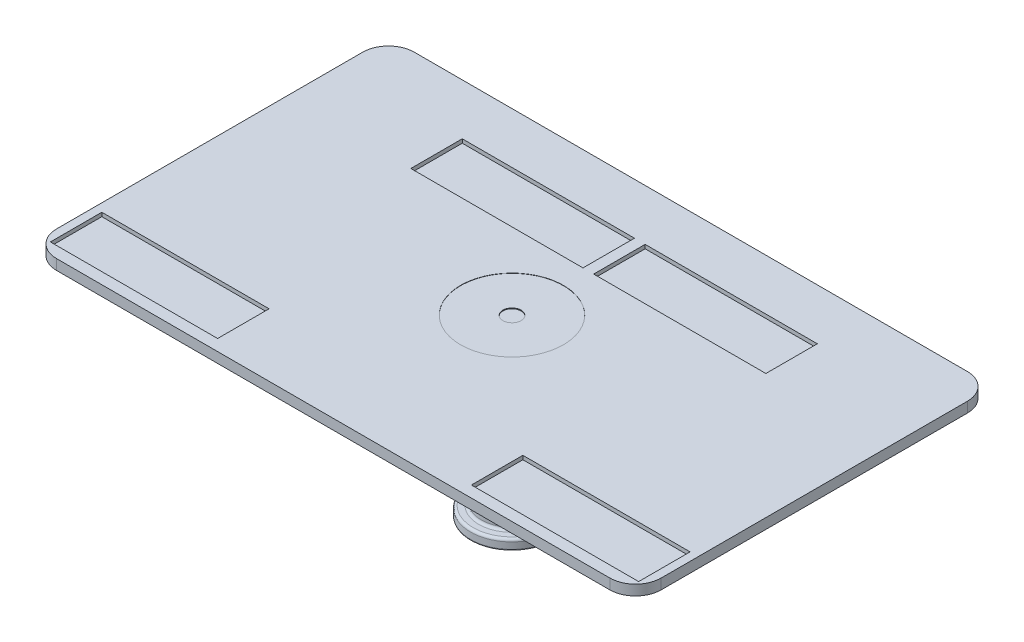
ISO-10303-21;
HEADER;
FILE_DESCRIPTION(('STEP AP214'),'2;1');
FILE_NAME('part.step','',(''),(''),'','','');
FILE_SCHEMA(('AUTOMOTIVE_DESIGN { 1 0 10303 214 1 1 1 1 }'));
ENDSEC;
DATA;
#1=APPLICATION_CONTEXT('core data for automotive mechanical design processes');
#2=APPLICATION_PROTOCOL_DEFINITION('international standard','automotive_design',2000,#1);
#3=PRODUCT_CONTEXT('',#1,'mechanical');
#4=PRODUCT('Part','Part','',(#3));
#5=PRODUCT_RELATED_PRODUCT_CATEGORY('part','',(#4));
#6=PRODUCT_DEFINITION_FORMATION('','',#4);
#7=PRODUCT_DEFINITION_CONTEXT('part definition',#1,'design');
#8=PRODUCT_DEFINITION('design','',#6,#7);
#9=PRODUCT_DEFINITION_SHAPE('','',#8);
#10=(LENGTH_UNIT() NAMED_UNIT(*) SI_UNIT(.MILLI.,.METRE.));
#11=(NAMED_UNIT(*) PLANE_ANGLE_UNIT() SI_UNIT($,.RADIAN.));
#12=(NAMED_UNIT(*) SI_UNIT($,.STERADIAN.) SOLID_ANGLE_UNIT());
#13=UNCERTAINTY_MEASURE_WITH_UNIT(LENGTH_MEASURE(1.E-05),#10,'distance_accuracy_value','');
#14=(GEOMETRIC_REPRESENTATION_CONTEXT(3) GLOBAL_UNCERTAINTY_ASSIGNED_CONTEXT((#13)) GLOBAL_UNIT_ASSIGNED_CONTEXT((#10,
#11,#12)) REPRESENTATION_CONTEXT('',''));
#15=CARTESIAN_POINT('',(0.,0.,0.));
#16=DIRECTION('',(0.,0.,1.));
#17=DIRECTION('',(1.,0.,0.));
#18=AXIS2_PLACEMENT_3D('',#15,#16,#17);
#19=CARTESIAN_POINT('',(0.,0.4,6.50963986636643));
#20=DIRECTION('',(0.,0.,-1.));
#21=DIRECTION('',(-1.,0.,0.));
#22=AXIS2_PLACEMENT_3D('',#19,#20,#21);
#23=PLANE('',#22);
#24=DIRECTION('',(0.,-1.,0.));
#25=VECTOR('',#24,1.);
#26=CARTESIAN_POINT('',(12.285563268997,0.4,6.50963986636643));
#27=LINE('',#26,#25);
#28=CARTESIAN_POINT('',(12.285563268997,0.4,6.50963986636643));
#29=VERTEX_POINT('',#28);
#30=CARTESIAN_POINT('',(12.285563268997,0.25,6.50963986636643));
#31=VERTEX_POINT('',#30);
#32=EDGE_CURVE('E242',#29,#31,#27,.T.);
#33=ORIENTED_EDGE('',*,*,#32,.T.);
#34=DIRECTION('',(1.,0.,0.));
#35=VECTOR('',#34,1.);
#36=CARTESIAN_POINT('',(12.285563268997,0.25,6.50963986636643));
#37=LINE('',#36,#35);
#38=CARTESIAN_POINT('',(5.78556326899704,0.25,6.50963986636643));
#39=VERTEX_POINT('',#38);
#40=EDGE_CURVE('E230',#39,#31,#37,.T.);
#41=ORIENTED_EDGE('',*,*,#40,.F.);
#42=DIRECTION('',(0.,-1.,0.));
#43=VECTOR('',#42,1.);
#44=CARTESIAN_POINT('',(5.78556326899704,0.4,6.50963986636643));
#45=LINE('',#44,#43);
#46=CARTESIAN_POINT('',(5.78556326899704,0.4,6.50963986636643));
#47=VERTEX_POINT('',#46);
#48=EDGE_CURVE('E227',#47,#39,#45,.T.);
#49=ORIENTED_EDGE('',*,*,#48,.F.);
#50=DIRECTION('',(1.,0.,0.));
#51=VECTOR('',#50,1.);
#52=CARTESIAN_POINT('',(0.,0.4,6.50963986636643));
#53=LINE('',#52,#51);
#54=EDGE_CURVE('E387',#47,#29,#53,.T.);
#55=ORIENTED_EDGE('',*,*,#54,.T.);
#56=EDGE_LOOP('',(#33,#41,#49,#55));
#57=FACE_BOUND('',#56,.T.);
#58=ADVANCED_FACE('F47',(#57),#23,.T.);
#59=CARTESIAN_POINT('',(5.78556326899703,0.4,0.));
#60=DIRECTION('',(-1.,0.,0.));
#61=DIRECTION('',(0.,0.,1.));
#62=AXIS2_PLACEMENT_3D('',#59,#60,#61);
#63=PLANE('',#62);
#64=DIRECTION('',(0.,0.,1.));
#65=VECTOR('',#64,1.);
#66=CARTESIAN_POINT('',(5.78556326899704,0.25,6.50963986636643));
#67=LINE('',#66,#65);
#68=CARTESIAN_POINT('',(5.78556326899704,0.25,4.50963986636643));
#69=VERTEX_POINT('',#68);
#70=EDGE_CURVE('E211',#69,#39,#67,.T.);
#71=ORIENTED_EDGE('',*,*,#70,.F.);
#72=DIRECTION('',(0.,-1.,0.));
#73=VECTOR('',#72,1.);
#74=CARTESIAN_POINT('',(5.78556326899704,0.4,4.50963986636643));
#75=LINE('',#74,#73);
#76=CARTESIAN_POINT('',(5.78556326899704,0.4,4.50963986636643));
#77=VERTEX_POINT('',#76);
#78=EDGE_CURVE('E226',#77,#69,#75,.T.);
#79=ORIENTED_EDGE('',*,*,#78,.F.);
#80=DIRECTION('',(0.,0.,-1.));
#81=VECTOR('',#80,1.);
#82=CARTESIAN_POINT('',(5.78556326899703,0.4,0.));
#83=LINE('',#82,#81);
#84=EDGE_CURVE('E514',#47,#77,#83,.T.);
#85=ORIENTED_EDGE('',*,*,#84,.F.);
#86=ORIENTED_EDGE('',*,*,#48,.T.);
#87=EDGE_LOOP('',(#71,#79,#85,#86));
#88=FACE_BOUND('',#87,.T.);
#89=ADVANCED_FACE('F224',(#88),#63,.F.);
#90=CARTESIAN_POINT('',(0.,0.4,4.50963986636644));
#91=DIRECTION('',(0.,0.,-1.));
#92=DIRECTION('',(-1.,0.,0.));
#93=AXIS2_PLACEMENT_3D('',#90,#91,#92);
#94=PLANE('',#93);
#95=DIRECTION('',(-1.,0.,0.));
#96=VECTOR('',#95,1.);
#97=CARTESIAN_POINT('',(5.78556326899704,0.25,4.50963986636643));
#98=LINE('',#97,#96);
#99=CARTESIAN_POINT('',(12.285563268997,0.25,4.50963986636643));
#100=VERTEX_POINT('',#99);
#101=EDGE_CURVE('E208',#100,#69,#98,.T.);
#102=ORIENTED_EDGE('',*,*,#101,.F.);
#103=DIRECTION('',(0.,-1.,0.));
#104=VECTOR('',#103,1.);
#105=CARTESIAN_POINT('',(12.285563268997,0.4,4.50963986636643));
#106=LINE('',#105,#104);
#107=CARTESIAN_POINT('',(12.285563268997,0.4,4.50963986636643));
#108=VERTEX_POINT('',#107);
#109=EDGE_CURVE('E236',#108,#100,#106,.T.);
#110=ORIENTED_EDGE('',*,*,#109,.F.);
#111=DIRECTION('',(1.,0.,0.));
#112=VECTOR('',#111,1.);
#113=CARTESIAN_POINT('',(0.,0.4,4.50963986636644));
#114=LINE('',#113,#112);
#115=EDGE_CURVE('E233',#77,#108,#114,.T.);
#116=ORIENTED_EDGE('',*,*,#115,.F.);
#117=ORIENTED_EDGE('',*,*,#78,.T.);
#118=EDGE_LOOP('',(#102,#110,#116,#117));
#119=FACE_BOUND('',#118,.T.);
#120=ADVANCED_FACE('F232',(#119),#94,.F.);
#121=CARTESIAN_POINT('',(12.285563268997,0.4,0.));
#122=DIRECTION('',(-1.,0.,0.));
#123=DIRECTION('',(0.,0.,1.));
#124=AXIS2_PLACEMENT_3D('',#121,#122,#123);
#125=PLANE('',#124);
#126=ORIENTED_EDGE('',*,*,#109,.T.);
#127=DIRECTION('',(0.,0.,-1.));
#128=VECTOR('',#127,1.);
#129=CARTESIAN_POINT('',(12.285563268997,0.25,4.50963986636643));
#130=LINE('',#129,#128);
#131=EDGE_CURVE('E214',#31,#100,#130,.T.);
#132=ORIENTED_EDGE('',*,*,#131,.F.);
#133=ORIENTED_EDGE('',*,*,#32,.F.);
#134=DIRECTION('',(0.,0.,-1.));
#135=VECTOR('',#134,1.);
#136=CARTESIAN_POINT('',(12.285563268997,0.4,0.));
#137=LINE('',#136,#135);
#138=EDGE_CURVE('E268',#29,#108,#137,.T.);
#139=ORIENTED_EDGE('',*,*,#138,.T.);
#140=EDGE_LOOP('',(#126,#132,#133,#139));
#141=FACE_BOUND('',#140,.T.);
#142=ADVANCED_FACE('F391',(#141),#125,.T.);
#143=CARTESIAN_POINT('',(0.,0.4,6.50963986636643));
#144=DIRECTION('',(0.,0.,1.));
#145=DIRECTION('',(1.,0.,0.));
#146=AXIS2_PLACEMENT_3D('',#143,#144,#145);
#147=PLANE('',#146);
#148=DIRECTION('',(1.,0.,0.));
#149=VECTOR('',#148,1.);
#150=CARTESIAN_POINT('',(-4.07784737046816,0.25,6.50963986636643));
#151=LINE('',#150,#149);
#152=CARTESIAN_POINT('',(-10.5778473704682,0.25,6.50963986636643));
#153=VERTEX_POINT('',#152);
#154=CARTESIAN_POINT('',(-4.07784737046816,0.25,6.50963986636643));
#155=VERTEX_POINT('',#154);
#156=EDGE_CURVE('E402',#153,#155,#151,.T.);
#157=ORIENTED_EDGE('',*,*,#156,.F.);
#158=DIRECTION('',(0.,-1.,0.));
#159=VECTOR('',#158,1.);
#160=CARTESIAN_POINT('',(-10.5778473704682,0.4,6.50963986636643));
#161=LINE('',#160,#159);
#162=CARTESIAN_POINT('',(-10.5778473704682,0.4,6.50963986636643));
#163=VERTEX_POINT('',#162);
#164=EDGE_CURVE('E259',#163,#153,#161,.T.);
#165=ORIENTED_EDGE('',*,*,#164,.F.);
#166=DIRECTION('',(-1.,0.,0.));
#167=VECTOR('',#166,1.);
#168=CARTESIAN_POINT('',(0.,0.4,6.50963986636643));
#169=LINE('',#168,#167);
#170=CARTESIAN_POINT('',(-4.07784737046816,0.4,6.50963986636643));
#171=VERTEX_POINT('',#170);
#172=EDGE_CURVE('E497',#171,#163,#169,.T.);
#173=ORIENTED_EDGE('',*,*,#172,.F.);
#174=DIRECTION('',(0.,-1.,0.));
#175=VECTOR('',#174,1.);
#176=CARTESIAN_POINT('',(-4.07784737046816,0.4,6.50963986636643));
#177=LINE('',#176,#175);
#178=EDGE_CURVE('E246',#171,#155,#177,.T.);
#179=ORIENTED_EDGE('',*,*,#178,.T.);
#180=EDGE_LOOP('',(#157,#165,#173,#179));
#181=FACE_BOUND('',#180,.T.);
#182=ADVANCED_FACE('F568',(#181),#147,.F.);
#183=CARTESIAN_POINT('',(-10.5778473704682,0.4,0.));
#184=DIRECTION('',(-1.,0.,0.));
#185=DIRECTION('',(0.,0.,1.));
#186=AXIS2_PLACEMENT_3D('',#183,#184,#185);
#187=PLANE('',#186);
#188=DIRECTION('',(0.,0.,1.));
#189=VECTOR('',#188,1.);
#190=CARTESIAN_POINT('',(-10.5778473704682,0.25,6.50963986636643));
#191=LINE('',#190,#189);
#192=CARTESIAN_POINT('',(-10.5778473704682,0.25,4.50963986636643));
#193=VERTEX_POINT('',#192);
#194=EDGE_CURVE('E405',#193,#153,#191,.T.);
#195=ORIENTED_EDGE('',*,*,#194,.F.);
#196=DIRECTION('',(0.,-1.,0.));
#197=VECTOR('',#196,1.);
#198=CARTESIAN_POINT('',(-10.5778473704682,0.4,4.50963986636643));
#199=LINE('',#198,#197);
#200=CARTESIAN_POINT('',(-10.5778473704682,0.4,4.50963986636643));
#201=VERTEX_POINT('',#200);
#202=EDGE_CURVE('E255',#201,#193,#199,.T.);
#203=ORIENTED_EDGE('',*,*,#202,.F.);
#204=DIRECTION('',(0.,0.,-1.));
#205=VECTOR('',#204,1.);
#206=CARTESIAN_POINT('',(-10.5778473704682,0.4,0.));
#207=LINE('',#206,#205);
#208=EDGE_CURVE('E501',#163,#201,#207,.T.);
#209=ORIENTED_EDGE('',*,*,#208,.F.);
#210=ORIENTED_EDGE('',*,*,#164,.T.);
#211=EDGE_LOOP('',(#195,#203,#209,#210));
#212=FACE_BOUND('',#211,.T.);
#213=ADVANCED_FACE('F564',(#212),#187,.F.);
#214=CARTESIAN_POINT('',(0.,0.4,4.50963986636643));
#215=DIRECTION('',(0.,0.,1.));
#216=DIRECTION('',(1.,0.,0.));
#217=AXIS2_PLACEMENT_3D('',#214,#215,#216);
#218=PLANE('',#217);
#219=ORIENTED_EDGE('',*,*,#202,.T.);
#220=DIRECTION('',(-1.,0.,0.));
#221=VECTOR('',#220,1.);
#222=CARTESIAN_POINT('',(-10.5778473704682,0.25,4.50963986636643));
#223=LINE('',#222,#221);
#224=CARTESIAN_POINT('',(-4.07784737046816,0.25,4.50963986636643));
#225=VERTEX_POINT('',#224);
#226=EDGE_CURVE('E229',#225,#193,#223,.T.);
#227=ORIENTED_EDGE('',*,*,#226,.F.);
#228=DIRECTION('',(0.,-1.,0.));
#229=VECTOR('',#228,1.);
#230=CARTESIAN_POINT('',(-4.07784737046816,0.4,4.50963986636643));
#231=LINE('',#230,#229);
#232=CARTESIAN_POINT('',(-4.07784737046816,0.4,4.50963986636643));
#233=VERTEX_POINT('',#232);
#234=EDGE_CURVE('E250',#233,#225,#231,.T.);
#235=ORIENTED_EDGE('',*,*,#234,.F.);
#236=DIRECTION('',(-1.,0.,0.));
#237=VECTOR('',#236,1.);
#238=CARTESIAN_POINT('',(0.,0.4,4.50963986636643));
#239=LINE('',#238,#237);
#240=EDGE_CURVE('E504',#233,#201,#239,.T.);
#241=ORIENTED_EDGE('',*,*,#240,.T.);
#242=EDGE_LOOP('',(#219,#227,#235,#241));
#243=FACE_BOUND('',#242,.T.);
#244=ADVANCED_FACE('F560',(#243),#218,.T.);
#245=CARTESIAN_POINT('',(-4.07784737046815,0.4,0.));
#246=DIRECTION('',(-1.,0.,0.));
#247=DIRECTION('',(0.,0.,1.));
#248=AXIS2_PLACEMENT_3D('',#245,#246,#247);
#249=PLANE('',#248);
#250=ORIENTED_EDGE('',*,*,#234,.T.);
#251=DIRECTION('',(0.,0.,-1.));
#252=VECTOR('',#251,1.);
#253=CARTESIAN_POINT('',(-4.07784737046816,0.25,4.50963986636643));
#254=LINE('',#253,#252);
#255=EDGE_CURVE('E399',#155,#225,#254,.T.);
#256=ORIENTED_EDGE('',*,*,#255,.F.);
#257=ORIENTED_EDGE('',*,*,#178,.F.);
#258=DIRECTION('',(0.,0.,-1.));
#259=VECTOR('',#258,1.);
#260=CARTESIAN_POINT('',(-4.07784737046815,0.4,0.));
#261=LINE('',#260,#259);
#262=EDGE_CURVE('E508',#171,#233,#261,.T.);
#263=ORIENTED_EDGE('',*,*,#262,.T.);
#264=EDGE_LOOP('',(#250,#256,#257,#263));
#265=FACE_BOUND('',#264,.T.);
#266=ADVANCED_FACE('F556',(#265),#249,.T.);
#267=CARTESIAN_POINT('',(0.,0.4,-2.96693910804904));
#268=DIRECTION('',(0.,0.,1.));
#269=DIRECTION('',(1.,0.,0.));
#270=AXIS2_PLACEMENT_3D('',#267,#268,#269);
#271=PLANE('',#270);
#272=DIRECTION('',(1.,0.,0.));
#273=VECTOR('',#272,1.);
#274=CARTESIAN_POINT('',(7.75385794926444,0.25,-2.96693910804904));
#275=LINE('',#274,#273);
#276=CARTESIAN_POINT('',(1.06153603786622,0.25,-2.96693910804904));
#277=VERTEX_POINT('',#276);
#278=CARTESIAN_POINT('',(7.75385794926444,0.25,-2.96693910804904));
#279=VERTEX_POINT('',#278);
#280=EDGE_CURVE('E416',#277,#279,#275,.T.);
#281=ORIENTED_EDGE('',*,*,#280,.F.);
#282=DIRECTION('',(0.,-1.,0.));
#283=VECTOR('',#282,1.);
#284=CARTESIAN_POINT('',(1.06153603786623,0.4,-2.96693910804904));
#285=LINE('',#284,#283);
#286=CARTESIAN_POINT('',(1.06153603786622,0.4,-2.96693910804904));
#287=VERTEX_POINT('',#286);
#288=EDGE_CURVE('E458',#287,#277,#285,.T.);
#289=ORIENTED_EDGE('',*,*,#288,.F.);
#290=DIRECTION('',(-1.,0.,0.));
#291=VECTOR('',#290,1.);
#292=CARTESIAN_POINT('',(0.,0.4,-2.96693910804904));
#293=LINE('',#292,#291);
#294=CARTESIAN_POINT('',(7.75385794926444,0.4,-2.96693910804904));
#295=VERTEX_POINT('',#294);
#296=EDGE_CURVE('E470',#295,#287,#293,.T.);
#297=ORIENTED_EDGE('',*,*,#296,.F.);
#298=DIRECTION('',(0.,-1.,0.));
#299=VECTOR('',#298,1.);
#300=CARTESIAN_POINT('',(7.75385794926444,0.4,-2.96693910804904));
#301=LINE('',#300,#299);
#302=EDGE_CURVE('E251',#295,#279,#301,.T.);
#303=ORIENTED_EDGE('',*,*,#302,.T.);
#304=EDGE_LOOP('',(#281,#289,#297,#303));
#305=FACE_BOUND('',#304,.T.);
#306=ADVANCED_FACE('F559',(#305),#271,.F.);
#307=CARTESIAN_POINT('',(0.,0.4,-4.96693910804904));
#308=DIRECTION('',(0.,0.,1.));
#309=DIRECTION('',(1.,0.,0.));
#310=AXIS2_PLACEMENT_3D('',#307,#308,#309);
#311=PLANE('',#310);
#312=DIRECTION('',(0.,-1.,0.));
#313=VECTOR('',#312,1.);
#314=CARTESIAN_POINT('',(1.06153603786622,0.4,-4.96693910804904));
#315=LINE('',#314,#313);
#316=CARTESIAN_POINT('',(1.06153603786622,0.4,-4.96693910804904));
#317=VERTEX_POINT('',#316);
#318=CARTESIAN_POINT('',(1.06153603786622,0.25,-4.96693910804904));
#319=VERTEX_POINT('',#318);
#320=EDGE_CURVE('E454',#317,#319,#315,.T.);
#321=ORIENTED_EDGE('',*,*,#320,.T.);
#322=DIRECTION('',(-1.,0.,0.));
#323=VECTOR('',#322,1.);
#324=CARTESIAN_POINT('',(1.06153603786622,0.25,-4.96693910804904));
#325=LINE('',#324,#323);
#326=CARTESIAN_POINT('',(7.75385794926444,0.25,-4.96693910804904));
#327=VERTEX_POINT('',#326);
#328=EDGE_CURVE('E408',#327,#319,#325,.T.);
#329=ORIENTED_EDGE('',*,*,#328,.F.);
#330=DIRECTION('',(0.,-1.,0.));
#331=VECTOR('',#330,1.);
#332=CARTESIAN_POINT('',(7.75385794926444,0.4,-4.96693910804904));
#333=LINE('',#332,#331);
#334=CARTESIAN_POINT('',(7.75385794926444,0.4,-4.96693910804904));
#335=VERTEX_POINT('',#334);
#336=EDGE_CURVE('E263',#335,#327,#333,.T.);
#337=ORIENTED_EDGE('',*,*,#336,.F.);
#338=DIRECTION('',(-1.,0.,0.));
#339=VECTOR('',#338,1.);
#340=CARTESIAN_POINT('',(0.,0.4,-4.96693910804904));
#341=LINE('',#340,#339);
#342=EDGE_CURVE('E479',#335,#317,#341,.T.);
#343=ORIENTED_EDGE('',*,*,#342,.T.);
#344=EDGE_LOOP('',(#321,#329,#337,#343));
#345=FACE_BOUND('',#344,.T.);
#346=ADVANCED_FACE('F585',(#345),#311,.T.);
#347=CARTESIAN_POINT('',(7.75385794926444,0.4,0.));
#348=DIRECTION('',(-1.,0.,0.));
#349=DIRECTION('',(0.,0.,1.));
#350=AXIS2_PLACEMENT_3D('',#347,#348,#349);
#351=PLANE('',#350);
#352=ORIENTED_EDGE('',*,*,#336,.T.);
#353=DIRECTION('',(0.,0.,-1.));
#354=VECTOR('',#353,1.);
#355=CARTESIAN_POINT('',(7.75385794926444,0.25,-4.96693910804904));
#356=LINE('',#355,#354);
#357=EDGE_CURVE('E412',#279,#327,#356,.T.);
#358=ORIENTED_EDGE('',*,*,#357,.F.);
#359=ORIENTED_EDGE('',*,*,#302,.F.);
#360=DIRECTION('',(0.,0.,-1.));
#361=VECTOR('',#360,1.);
#362=CARTESIAN_POINT('',(7.75385794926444,0.4,0.));
#363=LINE('',#362,#361);
#364=EDGE_CURVE('E377',#295,#335,#363,.T.);
#365=ORIENTED_EDGE('',*,*,#364,.T.);
#366=EDGE_LOOP('',(#352,#358,#359,#365));
#367=FACE_BOUND('',#366,.T.);
#368=ADVANCED_FACE('F588',(#367),#351,.T.);
#369=CARTESIAN_POINT('',(1.06153603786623,0.4,-2.96693910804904));
#370=DIRECTION('',(-1.,0.,0.));
#371=DIRECTION('',(0.,0.,1.));
#372=AXIS2_PLACEMENT_3D('',#369,#370,#371);
#373=PLANE('',#372);
#374=DIRECTION('',(0.,0.,1.));
#375=VECTOR('',#374,1.);
#376=CARTESIAN_POINT('',(1.06153603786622,0.25,-2.96693910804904));
#377=LINE('',#376,#375);
#378=EDGE_CURVE('E420',#319,#277,#377,.T.);
#379=ORIENTED_EDGE('',*,*,#378,.F.);
#380=ORIENTED_EDGE('',*,*,#320,.F.);
#381=DIRECTION('',(0.,0.,-1.));
#382=VECTOR('',#381,1.);
#383=CARTESIAN_POINT('',(1.06153603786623,0.4,-2.96693910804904));
#384=LINE('',#383,#382);
#385=EDGE_CURVE('E440',#287,#317,#384,.T.);
#386=ORIENTED_EDGE('',*,*,#385,.F.);
#387=ORIENTED_EDGE('',*,*,#288,.T.);
#388=EDGE_LOOP('',(#379,#380,#386,#387));
#389=FACE_BOUND('',#388,.T.);
#390=ADVANCED_FACE('F601',(#389),#373,.F.);
#391=DIRECTION('',(1.,0.,0.));
#392=VECTOR('',#391,1.);
#393=CARTESIAN_POINT('',(0.646179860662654,0.25,-2.96693910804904));
#394=LINE('',#393,#392);
#395=CARTESIAN_POINT('',(-6.04614205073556,0.25,-2.96693910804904));
#396=VERTEX_POINT('',#395);
#397=CARTESIAN_POINT('',(0.646179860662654,0.25,-2.96693910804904));
#398=VERTEX_POINT('',#397);
#399=EDGE_CURVE('E428',#396,#398,#394,.T.);
#400=ORIENTED_EDGE('',*,*,#399,.F.);
#401=DIRECTION('',(0.,-1.,0.));
#402=VECTOR('',#401,1.);
#403=CARTESIAN_POINT('',(-6.04614205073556,0.4,-2.96693910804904));
#404=LINE('',#403,#402);
#405=CARTESIAN_POINT('',(-6.04614205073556,0.4,-2.96693910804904));
#406=VERTEX_POINT('',#405);
#407=EDGE_CURVE('E272',#406,#396,#404,.T.);
#408=ORIENTED_EDGE('',*,*,#407,.F.);
#409=CARTESIAN_POINT('',(0.646179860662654,0.4,-2.96693910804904));
#410=VERTEX_POINT('',#409);
#411=EDGE_CURVE('E469',#410,#406,#293,.T.);
#412=ORIENTED_EDGE('',*,*,#411,.F.);
#413=DIRECTION('',(0.,-1.,0.));
#414=VECTOR('',#413,1.);
#415=CARTESIAN_POINT('',(0.646179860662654,0.4,-2.96693910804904));
#416=LINE('',#415,#414);
#417=EDGE_CURVE('E447',#410,#398,#416,.T.);
#418=ORIENTED_EDGE('',*,*,#417,.T.);
#419=EDGE_LOOP('',(#400,#408,#412,#418));
#420=FACE_BOUND('',#419,.T.);
#421=ADVANCED_FACE('F598',(#420),#271,.F.);
#422=DIRECTION('',(0.,-1.,0.));
#423=VECTOR('',#422,1.);
#424=CARTESIAN_POINT('',(-6.04614205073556,0.4,-4.96693910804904));
#425=LINE('',#424,#423);
#426=CARTESIAN_POINT('',(-6.04614205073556,0.4,-4.96693910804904));
#427=VERTEX_POINT('',#426);
#428=CARTESIAN_POINT('',(-6.04614205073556,0.25,-4.96693910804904));
#429=VERTEX_POINT('',#428);
#430=EDGE_CURVE('E267',#427,#429,#425,.T.);
#431=ORIENTED_EDGE('',*,*,#430,.T.);
#432=DIRECTION('',(-1.,0.,0.));
#433=VECTOR('',#432,1.);
#434=CARTESIAN_POINT('',(-6.04614205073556,0.25,-4.96693910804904));
#435=LINE('',#434,#433);
#436=CARTESIAN_POINT('',(0.646179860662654,0.25,-4.96693910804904));
#437=VERTEX_POINT('',#436);
#438=EDGE_CURVE('E436',#437,#429,#435,.T.);
#439=ORIENTED_EDGE('',*,*,#438,.F.);
#440=DIRECTION('',(0.,-1.,0.));
#441=VECTOR('',#440,1.);
#442=CARTESIAN_POINT('',(0.646179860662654,0.4,-4.96693910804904));
#443=LINE('',#442,#441);
#444=CARTESIAN_POINT('',(0.646179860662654,0.4,-4.96693910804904));
#445=VERTEX_POINT('',#444);
#446=EDGE_CURVE('E451',#445,#437,#443,.T.);
#447=ORIENTED_EDGE('',*,*,#446,.F.);
#448=EDGE_CURVE('E478',#445,#427,#341,.T.);
#449=ORIENTED_EDGE('',*,*,#448,.T.);
#450=EDGE_LOOP('',(#431,#439,#447,#449));
#451=FACE_BOUND('',#450,.T.);
#452=ADVANCED_FACE('F590',(#451),#311,.T.);
#453=CARTESIAN_POINT('',(-6.04614205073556,0.4,0.));
#454=DIRECTION('',(-1.,0.,0.));
#455=DIRECTION('',(0.,0.,1.));
#456=AXIS2_PLACEMENT_3D('',#453,#454,#455);
#457=PLANE('',#456);
#458=DIRECTION('',(0.,0.,1.));
#459=VECTOR('',#458,1.);
#460=CARTESIAN_POINT('',(-6.04614205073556,0.25,-2.96693910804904));
#461=LINE('',#460,#459);
#462=EDGE_CURVE('E424',#429,#396,#461,.T.);
#463=ORIENTED_EDGE('',*,*,#462,.F.);
#464=ORIENTED_EDGE('',*,*,#430,.F.);
#465=DIRECTION('',(0.,0.,-1.));
#466=VECTOR('',#465,1.);
#467=CARTESIAN_POINT('',(-6.04614205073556,0.4,0.));
#468=LINE('',#467,#466);
#469=EDGE_CURVE('E474',#406,#427,#468,.T.);
#470=ORIENTED_EDGE('',*,*,#469,.F.);
#471=ORIENTED_EDGE('',*,*,#407,.T.);
#472=EDGE_LOOP('',(#463,#464,#470,#471));
#473=FACE_BOUND('',#472,.T.);
#474=ADVANCED_FACE('F591',(#473),#457,.F.);
#475=CARTESIAN_POINT('',(0.646179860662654,0.4,-2.96693910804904));
#476=DIRECTION('',(1.,0.,0.));
#477=DIRECTION('',(0.,0.,-1.));
#478=AXIS2_PLACEMENT_3D('',#475,#476,#477);
#479=PLANE('',#478);
#480=DIRECTION('',(0.,0.,-1.));
#481=VECTOR('',#480,1.);
#482=CARTESIAN_POINT('',(0.646179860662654,0.25,-4.96693910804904));
#483=LINE('',#482,#481);
#484=EDGE_CURVE('E432',#398,#437,#483,.T.);
#485=ORIENTED_EDGE('',*,*,#484,.F.);
#486=ORIENTED_EDGE('',*,*,#417,.F.);
#487=DIRECTION('',(0.,0.,1.));
#488=VECTOR('',#487,1.);
#489=CARTESIAN_POINT('',(0.646179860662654,0.4,-2.96693910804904));
#490=LINE('',#489,#488);
#491=EDGE_CURVE('E443',#445,#410,#490,.T.);
#492=ORIENTED_EDGE('',*,*,#491,.F.);
#493=ORIENTED_EDGE('',*,*,#446,.T.);
#494=EDGE_LOOP('',(#485,#486,#492,#493));
#495=FACE_BOUND('',#494,.T.);
#496=ADVANCED_FACE('F583',(#495),#479,.F.);
#497=CARTESIAN_POINT('',(0.,0.4,-6.95));
#498=DIRECTION('',(0.,0.,1.));
#499=DIRECTION('',(1.,0.,0.));
#500=AXIS2_PLACEMENT_3D('',#497,#498,#499);
#501=PLANE('',#500);
#502=DIRECTION('',(-1.,0.,0.));
#503=VECTOR('',#502,1.);
#504=CARTESIAN_POINT('',(0.,0.,-6.95));
#505=LINE('',#504,#503);
#506=CARTESIAN_POINT('',(11.6038579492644,0.,-6.95));
#507=VERTEX_POINT('',#506);
#508=CARTESIAN_POINT('',(-9.89614205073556,0.,-6.95));
#509=VERTEX_POINT('',#508);
#510=EDGE_CURVE('E464',#507,#509,#505,.T.);
#511=ORIENTED_EDGE('',*,*,#510,.T.);
#512=DIRECTION('',(0.,-1.,0.));
#513=VECTOR('',#512,1.);
#514=CARTESIAN_POINT('',(-9.89614205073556,0.4,-6.95));
#515=LINE('',#514,#513);
#516=CARTESIAN_POINT('',(-9.89614205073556,0.4,-6.95));
#517=VERTEX_POINT('',#516);
#518=EDGE_CURVE('E355',#509,#517,#515,.F.);
#519=ORIENTED_EDGE('',*,*,#518,.T.);
#520=DIRECTION('',(-1.,0.,0.));
#521=VECTOR('',#520,1.);
#522=CARTESIAN_POINT('',(0.,0.4,-6.95));
#523=LINE('',#522,#521);
#524=CARTESIAN_POINT('',(11.6038579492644,0.4,-6.95));
#525=VERTEX_POINT('',#524);
#526=EDGE_CURVE('E483',#525,#517,#523,.T.);
#527=ORIENTED_EDGE('',*,*,#526,.F.);
#528=DIRECTION('',(0.,-1.,0.));
#529=VECTOR('',#528,1.);
#530=CARTESIAN_POINT('',(11.6038579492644,0.,-6.95));
#531=LINE('',#530,#529);
#532=EDGE_CURVE('E351',#525,#507,#531,.T.);
#533=ORIENTED_EDGE('',*,*,#532,.T.);
#534=EDGE_LOOP('',(#511,#519,#527,#533));
#535=FACE_BOUND('',#534,.T.);
#536=ADVANCED_FACE('F580',(#535),#501,.F.);
#537=CARTESIAN_POINT('',(-10.8961420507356,0.4,0.));
#538=DIRECTION('',(1.,0.,0.));
#539=DIRECTION('',(0.,0.,-1.));
#540=AXIS2_PLACEMENT_3D('',#537,#538,#539);
#541=PLANE('',#540);
#542=DIRECTION('',(0.,0.,1.));
#543=VECTOR('',#542,1.);
#544=CARTESIAN_POINT('',(-10.8961420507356,0.,0.));
#545=LINE('',#544,#543);
#546=CARTESIAN_POINT('',(-10.8961420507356,0.,-5.95));
#547=VERTEX_POINT('',#546);
#548=CARTESIAN_POINT('',(-10.8961420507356,0.,5.95));
#549=VERTEX_POINT('',#548);
#550=EDGE_CURVE('E379',#547,#549,#545,.T.);
#551=ORIENTED_EDGE('',*,*,#550,.T.);
#552=DIRECTION('',(0.,-1.,0.));
#553=VECTOR('',#552,1.);
#554=CARTESIAN_POINT('',(-10.8961420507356,0.4,5.95));
#555=LINE('',#554,#553);
#556=CARTESIAN_POINT('',(-10.8961420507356,0.4,5.95));
#557=VERTEX_POINT('',#556);
#558=EDGE_CURVE('E337',#549,#557,#555,.F.);
#559=ORIENTED_EDGE('',*,*,#558,.T.);
#560=DIRECTION('',(0.,0.,1.));
#561=VECTOR('',#560,1.);
#562=CARTESIAN_POINT('',(-10.8961420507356,0.4,0.));
#563=LINE('',#562,#561);
#564=CARTESIAN_POINT('',(-10.8961420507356,0.4,-5.95));
#565=VERTEX_POINT('',#564);
#566=EDGE_CURVE('E487',#565,#557,#563,.T.);
#567=ORIENTED_EDGE('',*,*,#566,.F.);
#568=DIRECTION('',(0.,-1.,0.));
#569=VECTOR('',#568,1.);
#570=CARTESIAN_POINT('',(-10.8961420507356,0.4,-5.95));
#571=LINE('',#570,#569);
#572=EDGE_CURVE('E333',#565,#547,#571,.T.);
#573=ORIENTED_EDGE('',*,*,#572,.T.);
#574=EDGE_LOOP('',(#551,#559,#567,#573));
#575=FACE_BOUND('',#574,.T.);
#576=ADVANCED_FACE('F528',(#575),#541,.F.);
#577=CARTESIAN_POINT('',(0.,0.4,6.95));
#578=DIRECTION('',(0.,0.,1.));
#579=DIRECTION('',(1.,0.,0.));
#580=AXIS2_PLACEMENT_3D('',#577,#578,#579);
#581=PLANE('',#580);
#582=DIRECTION('',(-1.,0.,0.));
#583=VECTOR('',#582,1.);
#584=CARTESIAN_POINT('',(0.,0.4,6.95));
#585=LINE('',#584,#583);
#586=CARTESIAN_POINT('',(11.6038579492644,0.4,6.95));
#587=VERTEX_POINT('',#586);
#588=CARTESIAN_POINT('',(-9.89614205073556,0.4,6.95));
#589=VERTEX_POINT('',#588);
#590=EDGE_CURVE('E491',#587,#589,#585,.T.);
#591=ORIENTED_EDGE('',*,*,#590,.T.);
#592=DIRECTION('',(0.,-1.,0.));
#593=VECTOR('',#592,1.);
#594=CARTESIAN_POINT('',(-9.89614205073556,0.,6.95));
#595=LINE('',#594,#593);
#596=CARTESIAN_POINT('',(-9.89614205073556,0.,6.95));
#597=VERTEX_POINT('',#596);
#598=EDGE_CURVE('E317',#589,#597,#595,.T.);
#599=ORIENTED_EDGE('',*,*,#598,.T.);
#600=DIRECTION('',(-1.,0.,0.));
#601=VECTOR('',#600,1.);
#602=CARTESIAN_POINT('',(0.,0.,6.95));
#603=LINE('',#602,#601);
#604=CARTESIAN_POINT('',(11.6038579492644,0.,6.95));
#605=VERTEX_POINT('',#604);
#606=EDGE_CURVE('E372',#605,#597,#603,.T.);
#607=ORIENTED_EDGE('',*,*,#606,.F.);
#608=DIRECTION('',(0.,-1.,0.));
#609=VECTOR('',#608,1.);
#610=CARTESIAN_POINT('',(11.6038579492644,0.4,6.95));
#611=LINE('',#610,#609);
#612=EDGE_CURVE('E314',#605,#587,#611,.F.);
#613=ORIENTED_EDGE('',*,*,#612,.T.);
#614=EDGE_LOOP('',(#591,#599,#607,#613));
#615=FACE_BOUND('',#614,.T.);
#616=ADVANCED_FACE('F538',(#615),#581,.T.);
#617=CARTESIAN_POINT('',(12.6038579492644,0.4,0.));
#618=DIRECTION('',(1.,0.,0.));
#619=DIRECTION('',(0.,0.,-1.));
#620=AXIS2_PLACEMENT_3D('',#617,#618,#619);
#621=PLANE('',#620);
#622=DIRECTION('',(0.,0.,1.));
#623=VECTOR('',#622,1.);
#624=CARTESIAN_POINT('',(12.6038579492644,0.,0.));
#625=LINE('',#624,#623);
#626=CARTESIAN_POINT('',(12.6038579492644,0.,-5.95));
#627=VERTEX_POINT('',#626);
#628=CARTESIAN_POINT('',(12.6038579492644,0.,5.95));
#629=VERTEX_POINT('',#628);
#630=EDGE_CURVE('E362',#627,#629,#625,.T.);
#631=ORIENTED_EDGE('',*,*,#630,.F.);
#632=DIRECTION('',(0.,-1.,0.));
#633=VECTOR('',#632,1.);
#634=CARTESIAN_POINT('',(12.6038579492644,0.4,-5.95));
#635=LINE('',#634,#633);
#636=CARTESIAN_POINT('',(12.6038579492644,0.4,-5.95));
#637=VERTEX_POINT('',#636);
#638=EDGE_CURVE('E11',#627,#637,#635,.F.);
#639=ORIENTED_EDGE('',*,*,#638,.T.);
#640=DIRECTION('',(0.,0.,1.));
#641=VECTOR('',#640,1.);
#642=CARTESIAN_POINT('',(12.6038579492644,0.4,0.));
#643=LINE('',#642,#641);
#644=CARTESIAN_POINT('',(12.6038579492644,0.4,5.95));
#645=VERTEX_POINT('',#644);
#646=EDGE_CURVE('E363',#637,#645,#643,.T.);
#647=ORIENTED_EDGE('',*,*,#646,.T.);
#648=DIRECTION('',(0.,-1.,0.));
#649=VECTOR('',#648,1.);
#650=CARTESIAN_POINT('',(12.6038579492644,0.4,5.95));
#651=LINE('',#650,#649);
#652=EDGE_CURVE('E56',#645,#629,#651,.T.);
#653=ORIENTED_EDGE('',*,*,#652,.T.);
#654=EDGE_LOOP('',(#631,#639,#647,#653));
#655=FACE_BOUND('',#654,.T.);
#656=ADVANCED_FACE('F361',(#655),#621,.T.);
#657=CARTESIAN_POINT('',(0.853857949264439,0.4,0.));
#658=DIRECTION('',(0.,-1.,0.));
#659=DIRECTION('',(0.,0.,-1.));
#660=AXIS2_PLACEMENT_3D('',#657,#658,#659);
#661=CYLINDRICAL_SURFACE('',#660,2.);
#662=CARTESIAN_POINT('',(0.853857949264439,0.39,0.));
#663=DIRECTION('',(0.,1.,0.));
#664=DIRECTION('',(0.,0.,1.));
#665=AXIS2_PLACEMENT_3D('',#662,#663,#664);
#666=CIRCLE('',#665,2.);
#667=CARTESIAN_POINT('',(0.853857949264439,0.39,2.));
#668=VERTEX_POINT('',#667);
#669=EDGE_CURVE('E240',#668,#668,#666,.T.);
#670=ORIENTED_EDGE('',*,*,#669,.F.);
#671=EDGE_LOOP('',(#670));
#672=FACE_BOUND('',#671,.T.);
#673=CARTESIAN_POINT('',(0.853857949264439,0.4,0.));
#674=DIRECTION('',(0.,1.,0.));
#675=DIRECTION('',(0.,0.,1.));
#676=AXIS2_PLACEMENT_3D('',#673,#674,#675);
#677=CIRCLE('',#676,2.);
#678=CARTESIAN_POINT('',(0.853857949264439,0.4,2.));
#679=VERTEX_POINT('',#678);
#680=EDGE_CURVE('E371',#679,#679,#677,.T.);
#681=ORIENTED_EDGE('',*,*,#680,.T.);
#682=EDGE_LOOP('',(#681));
#683=FACE_BOUND('',#682,.T.);
#684=ADVANCED_FACE('F575',(#672,#683),#661,.F.);
#685=CARTESIAN_POINT('',(0.,0.4,0.));
#686=DIRECTION('',(0.,1.,0.));
#687=DIRECTION('',(0.,0.,1.));
#688=AXIS2_PLACEMENT_3D('',#685,#686,#687);
#689=PLANE('',#688);
#690=ORIENTED_EDGE('',*,*,#296,.T.);
#691=ORIENTED_EDGE('',*,*,#385,.T.);
#692=ORIENTED_EDGE('',*,*,#342,.F.);
#693=ORIENTED_EDGE('',*,*,#364,.F.);
#694=EDGE_LOOP('',(#690,#691,#692,#693));
#695=FACE_BOUND('',#694,.T.);
#696=ORIENTED_EDGE('',*,*,#680,.F.);
#697=EDGE_LOOP('',(#696));
#698=FACE_BOUND('',#697,.T.);
#699=ORIENTED_EDGE('',*,*,#491,.T.);
#700=ORIENTED_EDGE('',*,*,#411,.T.);
#701=ORIENTED_EDGE('',*,*,#469,.T.);
#702=ORIENTED_EDGE('',*,*,#448,.F.);
#703=EDGE_LOOP('',(#699,#700,#701,#702));
#704=FACE_BOUND('',#703,.T.);
#705=ORIENTED_EDGE('',*,*,#566,.T.);
#706=CARTESIAN_POINT('',(-9.89614205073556,0.4,5.95));
#707=DIRECTION('',(0.,1.,0.));
#708=DIRECTION('',(0.,0.,1.));
#709=AXIS2_PLACEMENT_3D('',#706,#707,#708);
#710=CIRCLE('',#709,1.);
#711=EDGE_CURVE('E348',#557,#589,#710,.T.);
#712=ORIENTED_EDGE('',*,*,#711,.T.);
#713=ORIENTED_EDGE('',*,*,#590,.F.);
#714=CARTESIAN_POINT('',(11.6038579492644,0.4,5.95));
#715=DIRECTION('',(0.,1.,0.));
#716=DIRECTION('',(0.,0.,1.));
#717=AXIS2_PLACEMENT_3D('',#714,#715,#716);
#718=CIRCLE('',#717,1.);
#719=EDGE_CURVE('E63',#587,#645,#718,.T.);
#720=ORIENTED_EDGE('',*,*,#719,.T.);
#721=ORIENTED_EDGE('',*,*,#646,.F.);
#722=CARTESIAN_POINT('',(11.6038579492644,0.4,-5.95));
#723=DIRECTION('',(0.,1.,0.));
#724=DIRECTION('',(0.,0.,1.));
#725=AXIS2_PLACEMENT_3D('',#722,#723,#724);
#726=CIRCLE('',#725,1.);
#727=EDGE_CURVE('E342',#637,#525,#726,.T.);
#728=ORIENTED_EDGE('',*,*,#727,.T.);
#729=ORIENTED_EDGE('',*,*,#526,.T.);
#730=CARTESIAN_POINT('',(-9.89614205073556,0.4,-5.95));
#731=DIRECTION('',(0.,1.,0.));
#732=DIRECTION('',(0.,0.,1.));
#733=AXIS2_PLACEMENT_3D('',#730,#731,#732);
#734=CIRCLE('',#733,1.);
#735=EDGE_CURVE('E345',#517,#565,#734,.T.);
#736=ORIENTED_EDGE('',*,*,#735,.T.);
#737=EDGE_LOOP('',(#705,#712,#713,#720,#721,#728,#729,#736));
#738=FACE_BOUND('',#737,.T.);
#739=ORIENTED_EDGE('',*,*,#172,.T.);
#740=ORIENTED_EDGE('',*,*,#208,.T.);
#741=ORIENTED_EDGE('',*,*,#240,.F.);
#742=ORIENTED_EDGE('',*,*,#262,.F.);
#743=EDGE_LOOP('',(#739,#740,#741,#742));
#744=FACE_BOUND('',#743,.T.);
#745=ORIENTED_EDGE('',*,*,#54,.F.);
#746=ORIENTED_EDGE('',*,*,#84,.T.);
#747=ORIENTED_EDGE('',*,*,#115,.T.);
#748=ORIENTED_EDGE('',*,*,#138,.F.);
#749=EDGE_LOOP('',(#745,#746,#747,#748));
#750=FACE_BOUND('',#749,.T.);
#751=ADVANCED_FACE('F535',(#695,#698,#704,#738,#744,#750),#689,.T.);
#752=CARTESIAN_POINT('',(0.,0.,0.));
#753=DIRECTION('',(0.,1.,0.));
#754=DIRECTION('',(0.,0.,1.));
#755=AXIS2_PLACEMENT_3D('',#752,#753,#754);
#756=PLANE('',#755);
#757=CARTESIAN_POINT('',(0.853857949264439,0.,0.));
#758=DIRECTION('',(0.,1.,0.));
#759=DIRECTION('',(0.,0.,1.));
#760=AXIS2_PLACEMENT_3D('',#757,#758,#759);
#761=CIRCLE('',#760,1.19256491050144);
#762=CARTESIAN_POINT('',(0.853857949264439,0.,1.19256491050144));
#763=VERTEX_POINT('',#762);
#764=EDGE_CURVE('E286',#763,#763,#761,.F.);
#765=ORIENTED_EDGE('',*,*,#764,.F.);
#766=EDGE_LOOP('',(#765));
#767=FACE_BOUND('',#766,.T.);
#768=ORIENTED_EDGE('',*,*,#606,.T.);
#769=CARTESIAN_POINT('',(-9.89614205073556,0.,5.95));
#770=DIRECTION('',(0.,1.,0.));
#771=DIRECTION('',(0.,0.,1.));
#772=AXIS2_PLACEMENT_3D('',#769,#770,#771);
#773=CIRCLE('',#772,1.);
#774=EDGE_CURVE('E330',#597,#549,#773,.F.);
#775=ORIENTED_EDGE('',*,*,#774,.T.);
#776=ORIENTED_EDGE('',*,*,#550,.F.);
#777=CARTESIAN_POINT('',(-9.89614205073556,0.,-5.95));
#778=DIRECTION('',(0.,1.,0.));
#779=DIRECTION('',(0.,0.,1.));
#780=AXIS2_PLACEMENT_3D('',#777,#778,#779);
#781=CIRCLE('',#780,1.);
#782=EDGE_CURVE('E327',#547,#509,#781,.F.);
#783=ORIENTED_EDGE('',*,*,#782,.T.);
#784=ORIENTED_EDGE('',*,*,#510,.F.);
#785=CARTESIAN_POINT('',(11.6038579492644,0.,-5.95));
#786=DIRECTION('',(0.,1.,0.));
#787=DIRECTION('',(0.,0.,1.));
#788=AXIS2_PLACEMENT_3D('',#785,#786,#787);
#789=CIRCLE('',#788,1.);
#790=EDGE_CURVE('E324',#507,#627,#789,.F.);
#791=ORIENTED_EDGE('',*,*,#790,.T.);
#792=ORIENTED_EDGE('',*,*,#630,.T.);
#793=CARTESIAN_POINT('',(11.6038579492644,0.,5.95));
#794=DIRECTION('',(0.,1.,0.));
#795=DIRECTION('',(0.,0.,1.));
#796=AXIS2_PLACEMENT_3D('',#793,#794,#795);
#797=CIRCLE('',#796,1.);
#798=EDGE_CURVE('E321',#629,#605,#797,.F.);
#799=ORIENTED_EDGE('',*,*,#798,.T.);
#800=EDGE_LOOP('',(#768,#775,#776,#783,#784,#791,#792,#799));
#801=FACE_BOUND('',#800,.T.);
#802=ADVANCED_FACE('F367',(#767,#801),#756,.F.);
#803=CARTESIAN_POINT('',(0.853857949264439,0.39,0.));
#804=DIRECTION('',(0.,-1.,0.));
#805=DIRECTION('',(0.,0.,-1.));
#806=AXIS2_PLACEMENT_3D('',#803,#804,#805);
#807=CYLINDRICAL_SURFACE('',#806,0.354056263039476);
#808=CARTESIAN_POINT('',(0.853857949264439,0.36,0.));
#809=DIRECTION('',(0.,1.,0.));
#810=DIRECTION('',(0.,0.,1.));
#811=AXIS2_PLACEMENT_3D('',#808,#809,#810);
#812=CIRCLE('',#811,0.354056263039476);
#813=CARTESIAN_POINT('',(0.853857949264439,0.36,0.354056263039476));
#814=VERTEX_POINT('',#813);
#815=EDGE_CURVE('E282',#814,#814,#812,.T.);
#816=ORIENTED_EDGE('',*,*,#815,.F.);
#817=EDGE_LOOP('',(#816));
#818=FACE_BOUND('',#817,.T.);
#819=CARTESIAN_POINT('',(0.853857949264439,0.39,0.));
#820=DIRECTION('',(0.,1.,0.));
#821=DIRECTION('',(0.,0.,1.));
#822=AXIS2_PLACEMENT_3D('',#819,#820,#821);
#823=CIRCLE('',#822,0.354056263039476);
#824=CARTESIAN_POINT('',(0.853857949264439,0.39,0.354056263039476));
#825=VERTEX_POINT('',#824);
#826=EDGE_CURVE('E461',#825,#825,#823,.T.);
#827=ORIENTED_EDGE('',*,*,#826,.T.);
#828=EDGE_LOOP('',(#827));
#829=FACE_BOUND('',#828,.T.);
#830=ADVANCED_FACE('F857',(#818,#829),#807,.F.);
#831=CARTESIAN_POINT('',(0.,0.39,0.));
#832=DIRECTION('',(0.,1.,0.));
#833=DIRECTION('',(0.,0.,1.));
#834=AXIS2_PLACEMENT_3D('',#831,#832,#833);
#835=PLANE('',#834);
#836=ORIENTED_EDGE('',*,*,#826,.F.);
#837=EDGE_LOOP('',(#836));
#838=FACE_BOUND('',#837,.T.);
#839=ORIENTED_EDGE('',*,*,#669,.T.);
#840=EDGE_LOOP('',(#839));
#841=FACE_BOUND('',#840,.T.);
#842=ADVANCED_FACE('F846',(#838,#841),#835,.T.);
#843=CARTESIAN_POINT('',(0.,0.36,0.));
#844=DIRECTION('',(0.,1.,0.));
#845=DIRECTION('',(0.,0.,1.));
#846=AXIS2_PLACEMENT_3D('',#843,#844,#845);
#847=PLANE('',#846);
#848=ORIENTED_EDGE('',*,*,#815,.T.);
#849=EDGE_LOOP('',(#848));
#850=FACE_BOUND('',#849,.T.);
#851=ADVANCED_FACE('F731',(#850),#847,.T.);
#852=CARTESIAN_POINT('',(0.,0.25,0.));
#853=DIRECTION('',(0.,-1.,0.));
#854=DIRECTION('',(0.,0.,-1.));
#855=AXIS2_PLACEMENT_3D('',#852,#853,#854);
#856=PLANE('',#855);
#857=ORIENTED_EDGE('',*,*,#462,.T.);
#858=ORIENTED_EDGE('',*,*,#399,.T.);
#859=ORIENTED_EDGE('',*,*,#484,.T.);
#860=ORIENTED_EDGE('',*,*,#438,.T.);
#861=EDGE_LOOP('',(#857,#858,#859,#860));
#862=FACE_BOUND('',#861,.T.);
#863=ADVANCED_FACE('F723',(#862),#856,.F.);
#864=CARTESIAN_POINT('',(0.,0.25,0.));
#865=DIRECTION('',(0.,-1.,0.));
#866=DIRECTION('',(0.,0.,-1.));
#867=AXIS2_PLACEMENT_3D('',#864,#865,#866);
#868=PLANE('',#867);
#869=ORIENTED_EDGE('',*,*,#378,.T.);
#870=ORIENTED_EDGE('',*,*,#280,.T.);
#871=ORIENTED_EDGE('',*,*,#357,.T.);
#872=ORIENTED_EDGE('',*,*,#328,.T.);
#873=EDGE_LOOP('',(#869,#870,#871,#872));
#874=FACE_BOUND('',#873,.T.);
#875=ADVANCED_FACE('F714',(#874),#868,.F.);
#876=CARTESIAN_POINT('',(0.,0.25,0.));
#877=DIRECTION('',(0.,-1.,0.));
#878=DIRECTION('',(0.,0.,-1.));
#879=AXIS2_PLACEMENT_3D('',#876,#877,#878);
#880=PLANE('',#879);
#881=ORIENTED_EDGE('',*,*,#194,.T.);
#882=ORIENTED_EDGE('',*,*,#156,.T.);
#883=ORIENTED_EDGE('',*,*,#255,.T.);
#884=ORIENTED_EDGE('',*,*,#226,.T.);
#885=EDGE_LOOP('',(#881,#882,#883,#884));
#886=FACE_BOUND('',#885,.T.);
#887=ADVANCED_FACE('F706',(#886),#880,.F.);
#888=CARTESIAN_POINT('',(0.,0.25,0.));
#889=DIRECTION('',(0.,-1.,0.));
#890=DIRECTION('',(0.,0.,-1.));
#891=AXIS2_PLACEMENT_3D('',#888,#889,#890);
#892=PLANE('',#891);
#893=ORIENTED_EDGE('',*,*,#70,.T.);
#894=ORIENTED_EDGE('',*,*,#40,.T.);
#895=ORIENTED_EDGE('',*,*,#131,.T.);
#896=ORIENTED_EDGE('',*,*,#101,.T.);
#897=EDGE_LOOP('',(#893,#894,#895,#896));
#898=FACE_BOUND('',#897,.T.);
#899=ADVANCED_FACE('F210',(#898),#892,.F.);
#900=CARTESIAN_POINT('',(0.853857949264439,-6.,0.));
#901=DIRECTION('',(0.,1.,0.));
#902=DIRECTION('',(0.,0.,1.));
#903=AXIS2_PLACEMENT_3D('',#900,#901,#902);
#904=CYLINDRICAL_SURFACE('',#903,1.19256491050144);
#905=CARTESIAN_POINT('',(0.853857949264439,-5.9,0.));
#906=DIRECTION('',(0.,-1.,0.));
#907=DIRECTION('',(0.,0.,-1.));
#908=AXIS2_PLACEMENT_3D('',#905,#906,#907);
#909=CIRCLE('',#908,1.19256491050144);
#910=CARTESIAN_POINT('',(0.853857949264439,-5.9,-1.19256491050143));
#911=VERTEX_POINT('',#910);
#912=EDGE_CURVE('E302',#911,#911,#909,.F.);
#913=ORIENTED_EDGE('',*,*,#912,.T.);
#914=EDGE_LOOP('',(#913));
#915=FACE_BOUND('',#914,.T.);
#916=ORIENTED_EDGE('',*,*,#764,.T.);
#917=EDGE_LOOP('',(#916));
#918=FACE_BOUND('',#917,.T.);
#919=ADVANCED_FACE('F689',(#915,#918),#904,.T.);
#920=CARTESIAN_POINT('',(0.853857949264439,-6.4,0.));
#921=DIRECTION('',(0.,1.,0.));
#922=DIRECTION('',(0.,0.,1.));
#923=AXIS2_PLACEMENT_3D('',#920,#921,#922);
#924=CYLINDRICAL_SURFACE('',#923,1.609699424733);
#925=CARTESIAN_POINT('',(0.853857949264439,-6.35,0.));
#926=DIRECTION('',(0.,-1.,0.));
#927=DIRECTION('',(0.,0.,-1.));
#928=AXIS2_PLACEMENT_3D('',#925,#926,#927);
#929=CIRCLE('',#928,1.609699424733);
#930=CARTESIAN_POINT('',(0.853857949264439,-6.35,-1.609699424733));
#931=VERTEX_POINT('',#930);
#932=EDGE_CURVE('E310',#931,#931,#929,.F.);
#933=ORIENTED_EDGE('',*,*,#932,.T.);
#934=EDGE_LOOP('',(#933));
#935=FACE_BOUND('',#934,.T.);
#936=CARTESIAN_POINT('',(0.853857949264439,-6.1,0.));
#937=DIRECTION('',(0.,-1.,0.));
#938=DIRECTION('',(0.,0.,-1.));
#939=AXIS2_PLACEMENT_3D('',#936,#937,#938);
#940=CIRCLE('',#939,1.609699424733);
#941=CARTESIAN_POINT('',(0.853857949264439,-6.1,-1.609699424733));
#942=VERTEX_POINT('',#941);
#943=EDGE_CURVE('E290',#942,#942,#940,.T.);
#944=ORIENTED_EDGE('',*,*,#943,.T.);
#945=EDGE_LOOP('',(#944));
#946=FACE_BOUND('',#945,.T.);
#947=ADVANCED_FACE('F680',(#935,#946),#924,.T.);
#948=CARTESIAN_POINT('',(0.853857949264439,-6.4,0.));
#949=DIRECTION('',(0.,-1.,0.));
#950=DIRECTION('',(0.,0.,-1.));
#951=AXIS2_PLACEMENT_3D('',#948,#949,#950);
#952=PLANE('',#951);
#953=CARTESIAN_POINT('',(0.853857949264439,-6.4,0.));
#954=DIRECTION('',(0.,-1.,0.));
#955=DIRECTION('',(0.,0.,-1.));
#956=AXIS2_PLACEMENT_3D('',#953,#954,#955);
#957=CIRCLE('',#956,1.559699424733);
#958=CARTESIAN_POINT('',(0.853857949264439,-6.4,-1.559699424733));
#959=VERTEX_POINT('',#958);
#960=EDGE_CURVE('E306',#959,#959,#957,.T.);
#961=ORIENTED_EDGE('',*,*,#960,.T.);
#962=EDGE_LOOP('',(#961));
#963=FACE_BOUND('',#962,.T.);
#964=ADVANCED_FACE('F671',(#963),#952,.T.);
#965=CARTESIAN_POINT('',(0.853857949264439,-6.,0.));
#966=DIRECTION('',(0.,-1.,0.));
#967=DIRECTION('',(0.,0.,-1.));
#968=AXIS2_PLACEMENT_3D('',#965,#966,#967);
#969=PLANE('',#968);
#970=CARTESIAN_POINT('',(0.853857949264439,-6.,0.));
#971=DIRECTION('',(0.,-1.,0.));
#972=DIRECTION('',(0.,0.,-1.));
#973=AXIS2_PLACEMENT_3D('',#970,#971,#972);
#974=CIRCLE('',#973,1.509699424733);
#975=CARTESIAN_POINT('',(0.853857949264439,-6.,-1.509699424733));
#976=VERTEX_POINT('',#975);
#977=EDGE_CURVE('E298',#976,#976,#974,.F.);
#978=ORIENTED_EDGE('',*,*,#977,.T.);
#979=EDGE_LOOP('',(#978));
#980=FACE_BOUND('',#979,.T.);
#981=CARTESIAN_POINT('',(0.853857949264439,-6.,0.));
#982=DIRECTION('',(0.,-1.,0.));
#983=DIRECTION('',(0.,0.,-1.));
#984=AXIS2_PLACEMENT_3D('',#981,#982,#983);
#985=CIRCLE('',#984,1.29256491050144);
#986=CARTESIAN_POINT('',(0.853857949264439,-6.,-1.29256491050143));
#987=VERTEX_POINT('',#986);
#988=EDGE_CURVE('E294',#987,#987,#985,.T.);
#989=ORIENTED_EDGE('',*,*,#988,.T.);
#990=EDGE_LOOP('',(#989));
#991=FACE_BOUND('',#990,.T.);
#992=ADVANCED_FACE('F610',(#980,#991),#969,.F.);
#993=CARTESIAN_POINT('',(0.853857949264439,-6.1,0.));
#994=DIRECTION('',(0.,-1.,0.));
#995=DIRECTION('',(0.,0.,-1.));
#996=AXIS2_PLACEMENT_3D('',#993,#994,#995);
#997=TOROIDAL_SURFACE('',#996,1.509699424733,0.1);
#998=ORIENTED_EDGE('',*,*,#977,.F.);
#999=EDGE_LOOP('',(#998));
#1000=FACE_BOUND('',#999,.T.);
#1001=ORIENTED_EDGE('',*,*,#943,.F.);
#1002=EDGE_LOOP('',(#1001));
#1003=FACE_BOUND('',#1002,.T.);
#1004=ADVANCED_FACE('F606',(#1000,#1003),#997,.T.);
#1005=CARTESIAN_POINT('',(0.853857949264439,-5.9,0.));
#1006=DIRECTION('',(0.,-1.,0.));
#1007=DIRECTION('',(0.,0.,-1.));
#1008=AXIS2_PLACEMENT_3D('',#1005,#1006,#1007);
#1009=TOROIDAL_SURFACE('',#1008,1.29256491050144,0.1);
#1010=ORIENTED_EDGE('',*,*,#912,.F.);
#1011=EDGE_LOOP('',(#1010));
#1012=FACE_BOUND('',#1011,.T.);
#1013=ORIENTED_EDGE('',*,*,#988,.F.);
#1014=EDGE_LOOP('',(#1013));
#1015=FACE_BOUND('',#1014,.T.);
#1016=ADVANCED_FACE('F609',(#1012,#1015),#1009,.F.);
#1017=CARTESIAN_POINT('',(0.853857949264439,-6.35,0.));
#1018=DIRECTION('',(0.,-1.,0.));
#1019=DIRECTION('',(0.,0.,-1.));
#1020=AXIS2_PLACEMENT_3D('',#1017,#1018,#1019);
#1021=TOROIDAL_SURFACE('',#1020,1.559699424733,0.05);
#1022=ORIENTED_EDGE('',*,*,#932,.F.);
#1023=EDGE_LOOP('',(#1022));
#1024=FACE_BOUND('',#1023,.T.);
#1025=ORIENTED_EDGE('',*,*,#960,.F.);
#1026=EDGE_LOOP('',(#1025));
#1027=FACE_BOUND('',#1026,.T.);
#1028=ADVANCED_FACE('F614',(#1024,#1027),#1021,.T.);
#1029=CARTESIAN_POINT('',(-9.89614205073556,0.4,5.95));
#1030=DIRECTION('',(0.,1.,0.));
#1031=DIRECTION('',(0.,0.,1.));
#1032=AXIS2_PLACEMENT_3D('',#1029,#1030,#1031);
#1033=CYLINDRICAL_SURFACE('',#1032,1.);
#1034=ORIENTED_EDGE('',*,*,#711,.F.);
#1035=ORIENTED_EDGE('',*,*,#558,.F.);
#1036=ORIENTED_EDGE('',*,*,#774,.F.);
#1037=ORIENTED_EDGE('',*,*,#598,.F.);
#1038=EDGE_LOOP('',(#1034,#1035,#1036,#1037));
#1039=FACE_BOUND('',#1038,.T.);
#1040=ADVANCED_FACE('F533',(#1039),#1033,.T.);
#1041=CARTESIAN_POINT('',(-9.89614205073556,0.4,-5.95));
#1042=DIRECTION('',(0.,-1.,0.));
#1043=DIRECTION('',(0.,0.,-1.));
#1044=AXIS2_PLACEMENT_3D('',#1041,#1042,#1043);
#1045=CYLINDRICAL_SURFACE('',#1044,1.);
#1046=ORIENTED_EDGE('',*,*,#735,.F.);
#1047=ORIENTED_EDGE('',*,*,#518,.F.);
#1048=ORIENTED_EDGE('',*,*,#782,.F.);
#1049=ORIENTED_EDGE('',*,*,#572,.F.);
#1050=EDGE_LOOP('',(#1046,#1047,#1048,#1049));
#1051=FACE_BOUND('',#1050,.T.);
#1052=ADVANCED_FACE('F545',(#1051),#1045,.T.);
#1053=CARTESIAN_POINT('',(11.6038579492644,0.4,-5.95));
#1054=DIRECTION('',(0.,1.,0.));
#1055=DIRECTION('',(0.,0.,1.));
#1056=AXIS2_PLACEMENT_3D('',#1053,#1054,#1055);
#1057=CYLINDRICAL_SURFACE('',#1056,1.);
#1058=ORIENTED_EDGE('',*,*,#727,.F.);
#1059=ORIENTED_EDGE('',*,*,#638,.F.);
#1060=ORIENTED_EDGE('',*,*,#790,.F.);
#1061=ORIENTED_EDGE('',*,*,#532,.F.);
#1062=EDGE_LOOP('',(#1058,#1059,#1060,#1061));
#1063=FACE_BOUND('',#1062,.T.);
#1064=ADVANCED_FACE('F541',(#1063),#1057,.T.);
#1065=CARTESIAN_POINT('',(11.6038579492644,0.4,5.95));
#1066=DIRECTION('',(0.,-1.,0.));
#1067=DIRECTION('',(0.,0.,-1.));
#1068=AXIS2_PLACEMENT_3D('',#1065,#1066,#1067);
#1069=CYLINDRICAL_SURFACE('',#1068,1.);
#1070=ORIENTED_EDGE('',*,*,#719,.F.);
#1071=ORIENTED_EDGE('',*,*,#612,.F.);
#1072=ORIENTED_EDGE('',*,*,#798,.F.);
#1073=ORIENTED_EDGE('',*,*,#652,.F.);
#1074=EDGE_LOOP('',(#1070,#1071,#1072,#1073));
#1075=FACE_BOUND('',#1074,.T.);
#1076=ADVANCED_FACE('F49',(#1075),#1069,.T.);
#1077=CLOSED_SHELL('',(#58,#89,#120,#142,#182,#213,#244,#266,#306,#346,#368,#390,#421,#452,#474,
#496,#536,#576,#616,#656,#684,#751,#802,#830,#842,#851,#863,#875,#887,#899,#919,#947,#964,#992,
#1004,#1016,#1028,#1040,#1052,#1064,#1076));
#1078=MANIFOLD_SOLID_BREP('B2',#1077);
#1079=ADVANCED_BREP_SHAPE_REPRESENTATION('',(#18,#1078),#14);
#1080=SHAPE_DEFINITION_REPRESENTATION(#9,#1079);
ENDSEC;
END-ISO-10303-21;
